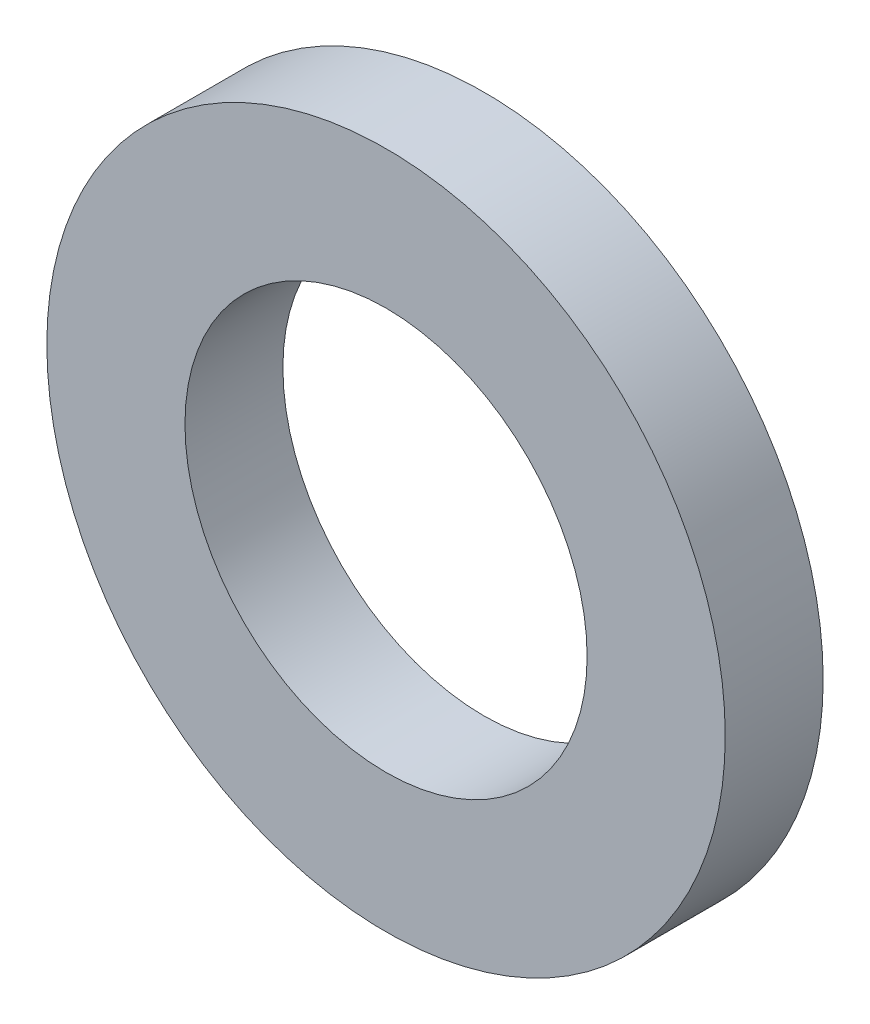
ISO-10303-21;
HEADER;
FILE_DESCRIPTION(('STEP AP214'),'2;1');
FILE_NAME('part.step','',(''),(''),'','','');
FILE_SCHEMA(('AUTOMOTIVE_DESIGN { 1 0 10303 214 1 1 1 1 }'));
ENDSEC;
DATA;
#1=APPLICATION_CONTEXT('core data for automotive mechanical design processes');
#2=APPLICATION_PROTOCOL_DEFINITION('international standard','automotive_design',2000,#1);
#3=PRODUCT_CONTEXT('',#1,'mechanical');
#4=PRODUCT('Part','Part','',(#3));
#5=PRODUCT_RELATED_PRODUCT_CATEGORY('part','',(#4));
#6=PRODUCT_DEFINITION_FORMATION('','',#4);
#7=PRODUCT_DEFINITION_CONTEXT('part definition',#1,'design');
#8=PRODUCT_DEFINITION('design','',#6,#7);
#9=PRODUCT_DEFINITION_SHAPE('','',#8);
#10=(LENGTH_UNIT() NAMED_UNIT(*) SI_UNIT(.MILLI.,.METRE.));
#11=(NAMED_UNIT(*) PLANE_ANGLE_UNIT() SI_UNIT($,.RADIAN.));
#12=(NAMED_UNIT(*) SI_UNIT($,.STERADIAN.) SOLID_ANGLE_UNIT());
#13=UNCERTAINTY_MEASURE_WITH_UNIT(LENGTH_MEASURE(1.E-05),#10,'distance_accuracy_value','');
#14=(GEOMETRIC_REPRESENTATION_CONTEXT(3) GLOBAL_UNCERTAINTY_ASSIGNED_CONTEXT((#13)) GLOBAL_UNIT_ASSIGNED_CONTEXT((#10,
#11,#12)) REPRESENTATION_CONTEXT('',''));
#15=CARTESIAN_POINT('',(0.,0.,0.));
#16=DIRECTION('',(0.,0.,1.));
#17=DIRECTION('',(1.,0.,0.));
#18=AXIS2_PLACEMENT_3D('',#15,#16,#17);
#19=CARTESIAN_POINT('',(0.,0.,2.8));
#20=DIRECTION('',(0.,0.,1.));
#21=DIRECTION('',(1.,0.,0.));
#22=AXIS2_PLACEMENT_3D('',#19,#20,#21);
#23=PLANE('',#22);
#24=CARTESIAN_POINT('',(0.,0.,2.8));
#25=DIRECTION('',(0.,0.,1.));
#26=DIRECTION('',(1.,0.,0.));
#27=AXIS2_PLACEMENT_3D('',#24,#25,#26);
#28=CIRCLE('',#27,9.7);
#29=CARTESIAN_POINT('',(9.70000000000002,0.,2.8));
#30=VERTEX_POINT('',#29);
#31=EDGE_CURVE('E10',#30,#30,#28,.T.);
#32=ORIENTED_EDGE('',*,*,#31,.T.);
#33=EDGE_LOOP('',(#32));
#34=FACE_BOUND('',#33,.T.);
#35=CARTESIAN_POINT('',(0.,0.,2.8));
#36=DIRECTION('',(0.,0.,1.));
#37=DIRECTION('',(1.,0.,0.));
#38=AXIS2_PLACEMENT_3D('',#35,#36,#37);
#39=CIRCLE('',#38,5.75);
#40=CARTESIAN_POINT('',(5.75000000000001,0.,2.8));
#41=VERTEX_POINT('',#40);
#42=EDGE_CURVE('E359',#41,#41,#39,.T.);
#43=ORIENTED_EDGE('',*,*,#42,.F.);
#44=EDGE_LOOP('',(#43));
#45=FACE_BOUND('',#44,.T.);
#46=ADVANCED_FACE('F348',(#34,#45),#23,.T.);
#47=CARTESIAN_POINT('',(0.,0.,0.));
#48=DIRECTION('',(0.,0.,1.));
#49=DIRECTION('',(1.,0.,0.));
#50=AXIS2_PLACEMENT_3D('',#47,#48,#49);
#51=PLANE('',#50);
#52=CARTESIAN_POINT('',(0.,0.,0.));
#53=DIRECTION('',(0.,0.,1.));
#54=DIRECTION('',(1.,0.,0.));
#55=AXIS2_PLACEMENT_3D('',#52,#53,#54);
#56=CIRCLE('',#55,9.7);
#57=CARTESIAN_POINT('',(9.70000000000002,0.,0.));
#58=VERTEX_POINT('',#57);
#59=EDGE_CURVE('E355',#58,#58,#56,.T.);
#60=ORIENTED_EDGE('',*,*,#59,.F.);
#61=EDGE_LOOP('',(#60));
#62=FACE_BOUND('',#61,.T.);
#63=CARTESIAN_POINT('',(0.,0.,0.));
#64=DIRECTION('',(0.,0.,1.));
#65=DIRECTION('',(1.,0.,0.));
#66=AXIS2_PLACEMENT_3D('',#63,#64,#65);
#67=CIRCLE('',#66,5.75);
#68=CARTESIAN_POINT('',(5.75000000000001,0.,0.));
#69=VERTEX_POINT('',#68);
#70=EDGE_CURVE('E363',#69,#69,#67,.T.);
#71=ORIENTED_EDGE('',*,*,#70,.T.);
#72=EDGE_LOOP('',(#71));
#73=FACE_BOUND('',#72,.T.);
#74=ADVANCED_FACE('F369',(#62,#73),#51,.F.);
#75=CARTESIAN_POINT('',(0.,0.,2.8));
#76=DIRECTION('',(0.,0.,-1.));
#77=DIRECTION('',(-1.,0.,0.));
#78=AXIS2_PLACEMENT_3D('',#75,#76,#77);
#79=CYLINDRICAL_SURFACE('',#78,9.7);
#80=ORIENTED_EDGE('',*,*,#31,.F.);
#81=EDGE_LOOP('',(#80));
#82=FACE_BOUND('',#81,.T.);
#83=ORIENTED_EDGE('',*,*,#59,.T.);
#84=EDGE_LOOP('',(#83));
#85=FACE_BOUND('',#84,.T.);
#86=ADVANCED_FACE('F350',(#82,#85),#79,.T.);
#87=CARTESIAN_POINT('',(0.,0.,2.8));
#88=DIRECTION('',(0.,0.,-1.));
#89=DIRECTION('',(-1.,0.,0.));
#90=AXIS2_PLACEMENT_3D('',#87,#88,#89);
#91=CYLINDRICAL_SURFACE('',#90,5.75);
#92=ORIENTED_EDGE('',*,*,#42,.T.);
#93=EDGE_LOOP('',(#92));
#94=FACE_BOUND('',#93,.T.);
#95=ORIENTED_EDGE('',*,*,#70,.F.);
#96=EDGE_LOOP('',(#95));
#97=FACE_BOUND('',#96,.T.);
#98=ADVANCED_FACE('F371',(#94,#97),#91,.F.);
#99=CLOSED_SHELL('',(#46,#74,#86,#98));
#100=MANIFOLD_SOLID_BREP('B2',#99);
#101=ADVANCED_BREP_SHAPE_REPRESENTATION('',(#18,#100),#14);
#102=SHAPE_DEFINITION_REPRESENTATION(#9,#101);
ENDSEC;
END-ISO-10303-21;
